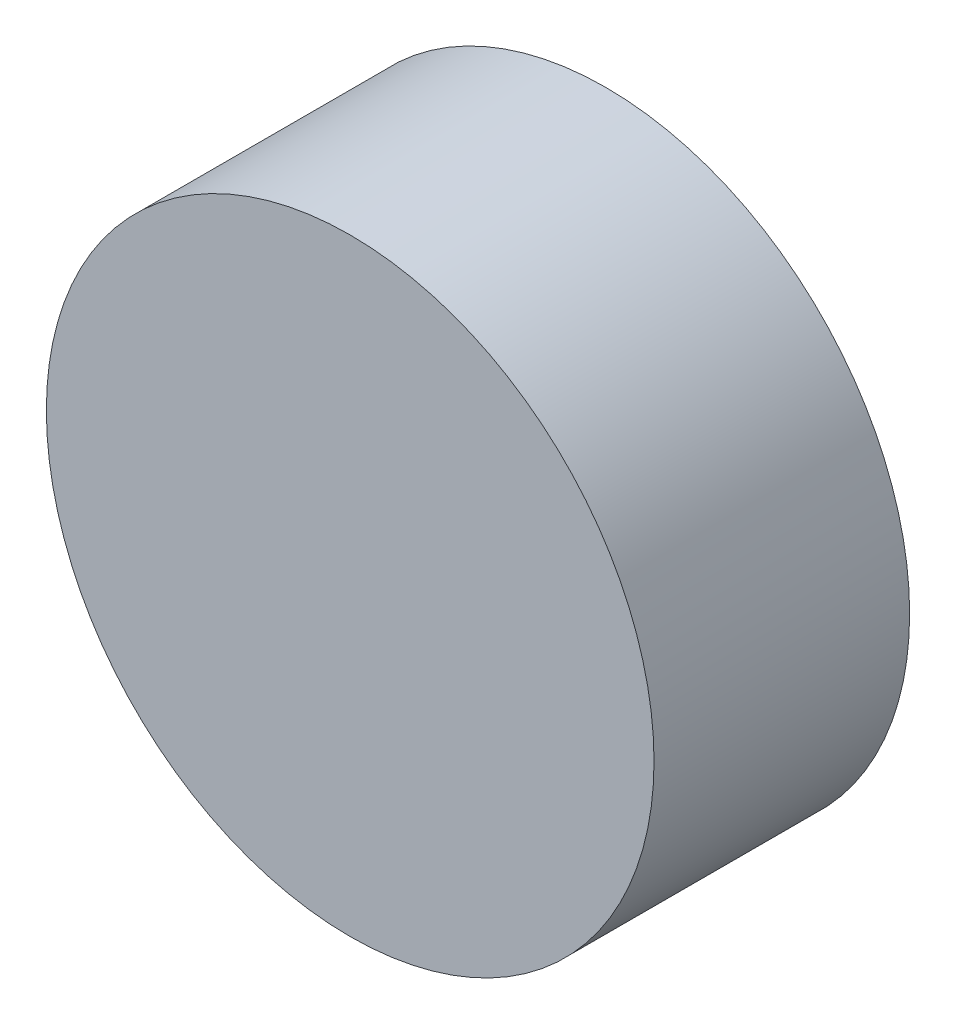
from build123d import *

# Parameters (mm, degrees)
SKETCH1_R           = 32.004
BOSS_EXTRUDE1_DEPTH = 26.924


with BuildPart() as part:
    # Sketch1 → Boss-Extrude1 (new body)
    with BuildSketch(Plane.XY):
        Circle(SKETCH1_R)
    extrude(amount=BOSS_EXTRUDE1_DEPTH)


solid = part.part
